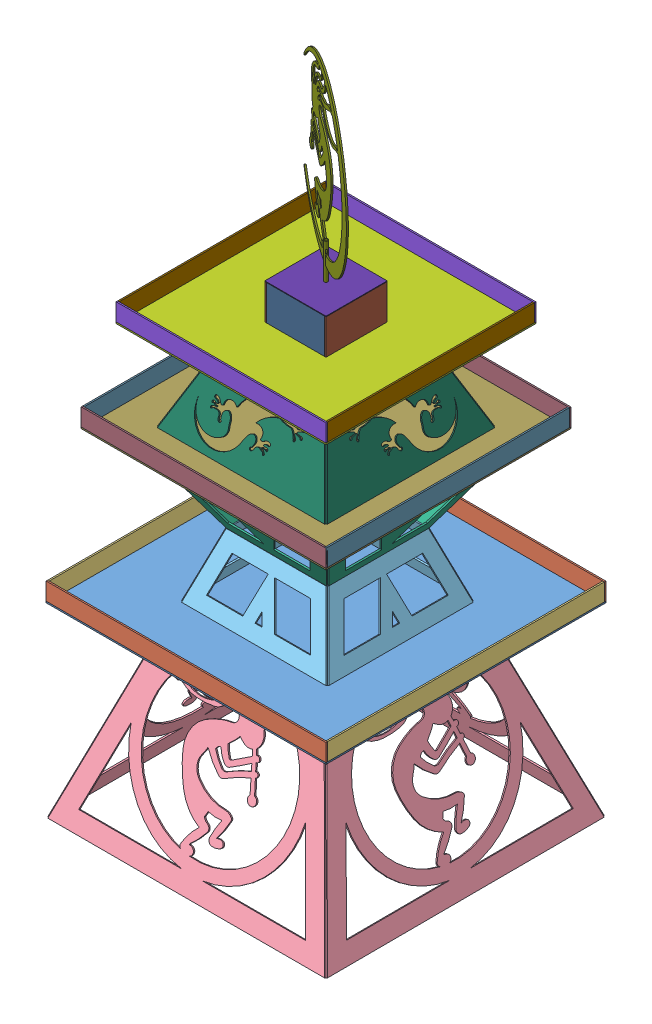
SolidWorks assembly full fountain.SLDASM, configuration Default (file format 8000). Lengths in mm.
Overall size (1229.96 3197.6 1720.92).
51 component instances, 18 part files, 28 mates.
Components (placement in the parent):
- Platform1-1: Platform1.SLDASM [Default] at (456.1958 589.5561 967.1555) size (1219.2 82.55 1219.2)
  - Platform1-1: Platform1.SLDPRT [Default] at (550.3577 745.2678 809.346) size (1219.2 6.35 1219.2)
  - Platform1-inner-shortside-1: Platform1-inner-shortside.SLDPRT [Default] at (550.3577 789.7178 936.346) (suppressed, hidden)
  - Platform1-inner-shortside-2: Platform1-inner-shortside.SLDPRT [Default] at (550.3577 789.7178 675.996) (suppressed, hidden)
  - Platform1-longside-1: Platform1-longside.SLDPRT [Default] at (550.3577 789.7178 1412.596) size (1219.2 76.2 6.35)
  - Platform1-longside-2: Platform1-longside.SLDPRT [Default] at (550.3577 789.7178 199.746) size (1219.2 76.2 6.35)
  - Platform1-outer-shortside-1: Platform1-outer-shortside.SLDPRT [Default] at (683.7077 789.7178 809.346) x (0 0 1) z (-1 0 0) (suppressed, hidden)
  - Platform1-outer-shortside-2: Platform1-outer-shortside.SLDPRT [Default] at (417.0077 789.7178 809.346) x (0 0 -1) z (1 0 0) (suppressed, hidden)
  - Platform1-shortside-1: Platform1-shortside.SLDPRT [Default] at (-52.8923 789.7178 809.346) x (0 0 1) z (-1 0 0) size (1206.5 76.2 6.35)
  - Platform1-shortside-2: Platform1-shortside.SLDPRT [Default] at (1153.6077 789.7178 809.346) x (0 0 -1) z (1 0 0) size (1206.5 76.2 6.35)
- Base1-1: Base1.SLDASM [Default] at (716.703 -86.3541 1585.036) x (1 0 0) z (0 0.326754 0.94511) size (1218.49 1173.84 1415.04)
  - Base1-1: Base1.SLDPRT [Default] at (317.5976 867.0186 935.9413) size (1206.5 868.38 6.35)
  - Base1-2: Base1.SLDPRT [Default] at (-140.6422 992.5277 576.7294) x (0 -0.329847 0.944034) z (-0.944034 0.311387 0.108799) size (1206.5 868.38 6.35)
  - Base1-3: Base1.SLDPRT [Default] at (239.865 1143.6766 144.1352) x (-1 0 0) z (0 0.622773 -0.782402) size (1206.5 868.38 6.35)
  - Base1-4: Base1.SLDPRT [Default] at (698.1048 1018.1676 503.3471) x (0 0.329847 -0.944034) z (0.944034 0.311387 0.108799) size (1206.5 868.38 6.35)
- base2 complete-1: base2 complete.SLDASM [Default] at (1041.5807 844.5542 1343.6375) x (1 0 0) z (0 0.329847 0.944034) size (890.2 1019.95 1086.26)
  - base2-tier1-1: base2-tier1.SLDASM [Default] at (-389.5691 -72.3187 234.6343) size (641.44 472.69 691.8)
    - Base-2-tier-1: Base-2-tier.SLDPRT [Default] at (399.4513 -22.7257 634.9553) size (629.45 295.21 6.35)
    - Base-2-tier-2: Base-2-tier.SLDPRT [Default] at (-58.7885 102.7833 275.7433) x (0 -0.329847 0.944034) z (-0.944034 0.311387 0.108799) size (629.45 295.21 6.35)
    - Base-2-tier-3: Base-2-tier.SLDPRT [Default] at (399.4513 257.8869 -161.8191) x (1 0 0) z (0 -0.622773 0.782402) size (629.45 295.21 6.35)
    - Base-2-tier-4: Base-2-tier.SLDPRT [Default] at (779.9585 128.4232 202.361) x (0 0.329847 -0.944034) z (0.944034 0.311387 0.108799) size (629.45 295.21 6.35)
  - base2-tier2-1: base2-tier2.SLDASM [Default] at (-355.6529 289.7699 -162.2429) x (1 0 0) z (0 0.207011 0.978339) size (890.2 772.31 946.89)
    - Base-2-tier2-2: Base-2-tier2.SLDPRT [Default] at (232.6721 -344.3629 633.1329) x (0 -0.518128 0.855303) z (-0.855303 0.443156 0.268456) size (879.34 429.08 6.35)
    - Base-2-tier2-3: Base-2-tier2.SLDPRT [Default] at (366.0986 -269.6028 516.0722) x (1 0 0) z (0 -0.886313 0.463087) size (879.34 429.08 6.35)
    - Base-2-tier2-4: Base-2-tier2.SLDPRT [Default] at (421.7924 -304.0874 566.648) x (0 0.518128 -0.855303) z (0.855303 0.443156 0.268456) size (879.34 429.08 6.35)
    - Base-2-tier2-5: Base-2-tier2.SLDPRT [Default] at (366.0986 -373.2194 680.7681) size (879.34 429.08 6.35)
- platform2-1: platform2.SLDASM [Default] at (696.2257 1865.4779 1091.7444) size (914.4 158.75 914.4)
  - Platform2-1: Platform2.SLDPRT [Default] at (310.3277 523.2857 684.7571) size (914.4 6.35 914.4)
  - Platform2-longside-1: Platform2-longside.SLDPRT [Default] at (310.3277 567.7357 1135.6071) size (914.4 76.2 6.35)
  - Platform2-shortside-1: Platform2-shortside.SLDPRT [Default] at (767.5277 567.7357 684.7571) x (0 0 1) z (-1 0 0) size (901.7 76.2 6.35)
  - Platform2-shortside-2: Platform2-shortside.SLDPRT [Default] at (-140.5223 567.7357 684.7571) x (0 0 1) z (-1 0 0) size (901.7 76.2 6.35)
  - Platform2-longside-3: Platform2-longside.SLDPRT [Default] at (310.3277 567.7357 227.5571) size (914.4 76.2 6.35)
  - Platform1-inner-shortside-1: Platform1-inner-shortside.SLDPRT [Default] at (310.3277 605.8357 551.4071)
  - Platform1-inner-shortside-3: Platform1-inner-shortside.SLDPRT [Default] at (310.3277 605.8357 811.7571)
  - Platform1-outer-shortside-3: Platform1-outer-shortside.SLDPRT [Default] at (437.3277 605.8357 684.7571) x (0 0 -1) z (1 0 0)
  - Platform1-outer-shortside-4: Platform1-outer-shortside.SLDPRT [Default] at (176.9777 605.8357 684.7571) x (0 0 -1) z (1 0 0)
- platoform3-middle-1: platoform3-middle.SLDASM [Default] at (571.6289 1389.8373 1010.4984) size (1066.8 82.55 1066.8)
  - Platform3-1: Platform3.SLDPRT [Default] at (434.9246 602.3995 766.003) size (1066.8 6.35 1066.8)
  - Platform3-longside-1: Platform3-longside.SLDPRT [Default] at (434.9246 646.8495 1293.053) size (1066.8 76.2 6.35)
  - Platform3-longside-2: Platform3-longside.SLDPRT [Default] at (434.9246 646.8495 232.603) size (1066.8 76.2 6.35)
  - Platform3-shortside-1: Platform3-shortside.SLDPRT [Default] at (968.3246 646.8495 769.178) x (0 0 1) z (-1 0 0) size (1060.45 76.2 6.35)
  - Platform3-shortside-2: Platform3-shortside.SLDPRT [Default] at (-92.1254 646.8495 769.178) x (0 0 1) z (-1 0 0) size (1060.45 76.2 6.35)
- tier3SLDASM-1: tier3SLDASM.SLDASM [Default] at (533.7527 1051.5559 1454.4573) x (1 0 0) z (0 0.408392 0.912807) size (740.82 653.97 829.22)
  - Base-3-tier-1: Base-3-tier.SLDPRT [Default] at (513.7761 -477.851 1015.4516) size (729.23 424.61 6.35)
  - Base-3-tier-2: Base-3-tier.SLDPRT [Default] at (513.7761 178.619 -445.4892) x (1 0 0) z (0 -0.745566 0.666432) size (729.23 424.61 6.35)
  - Base-3-tier-3: Base-3-tier.SLDPRT [Default] at (1278.6348 -165.4887 323.6336) x (0 -0.408392 0.912807) z (-0.912807 -0.372783 -0.166784) size (729.23 424.61 6.35)
  - Base-3-tier-4: Base-3-tier.SLDPRT [Default] at (-323.0188 -167.8559 322.5746) x (0 -0.408392 0.912807) z (-0.912807 0.372783 0.166784) size (729.23 424.61 6.35)
- Topper-1: Topper.SLDPRT [Default] at (918.1666 3074.9856 1721.7747) x (-0.833999 0 -0.551765) z (0.551765 0 -0.833999) size (655.16 785.54 15.88)
- top plate-1: top plate.SLDASM [Default] at (890.1202 2361.7834 1928.4355) x (1 0 0) z (0 1 0) size (266.7 266.7 103.12)
  - Top Plate-1: Top Plate.SLDPRT [Default] at (-16.9168 285.284 185.7302) size (266.7 266.7 2.79)
  - Tube For Top-1: Tube For Top.SLDPRT [Default] at (116.4332 151.934 288.8542) x (1 0 0) z (0 1 0) size (12.7 100.33 12.7)
Mates (geometry in assembly coordinates):
- Coincident1: coincident: plane of Platform1-1/Platform1-1 through (1006.5535 1334.8239 1776.5014) normal (0 -1 0); line of Base1-1/Base1-3 through (1312.252 1334.8239 1451.0755) axis (-1 0 0)
- Coincident2: coincident: line of Base1-1/Base1-1 through (678.6167 1334.8239 2090.7088) axis (1 0 0); plane of Platform1-1/Platform1-1 through (1006.5535 1334.8239 1776.5014) normal (0 -1 0)
- Coincident3: coincident: plane of Platform1-1/Platform1-1 through (1006.5535 1341.1739 1776.5014) normal (0 1 0); line of base2 complete-1/base2-tier1-1/Base-2-tier-1 through (697.8735 1341.1739 2091.2597) axis (1 0 0)
- Coincident4: coincident: plane of Platform1-1/Platform1-1 through (1006.5535 1341.1739 1776.5014) normal (0 1 0); line of base2 complete-1/base2-tier1-1/Base-2-tier-3 through (697.8735 1341.1739 1461.8135) axis (1 0 0)
- Coincident7: coincident aligned: plane of Platform1-1/Platform1-inner-shortside-2 through (1006.5535 1379.2739 1649.5014) normal (0 0 1); plane of platform2-1/Platform1-inner-shortside-1 through (1006.5535 2433.2136 1649.5014) normal (0 0 1)
- Coincident8: coincident aligned: plane of Platform1-1/Platform1-outer-shortside-2 through (879.5535 1379.2739 1776.5014) normal (1 0 0); plane of platform2-1/Platform1-outer-shortside-4 through (879.5535 2433.2136 1776.5014) normal (1 0 0)
- Coincident15: coincident: line of base2 complete-1/base2-tier2-1/Base-2-tier2-2 through (1452.8276 1992.2368 2215.6407) axis (0 0 -1); plane of platoform3-middle-1/Platform3-1 through (1006.5535 1992.2368 1776.5014) normal (0 -1 0)
- Coincident16: coincident: line of base2 complete-1/base2-tier2-1/Base-2-tier2-4 through (573.4926 1992.2368 1336.3056) axis (0 0 1); plane of platoform3-middle-1/Platform3-1 through (1006.5535 1992.2368 1776.5014) normal (0 -1 0)
- Coincident17: coincident: plane of platoform3-middle-1/Platform3-1 through (1006.5535 1998.5868 1776.5014) normal (0 1 0); line of tier3SLDASM-1/Base-3-tier-2 through (644.0498 1998.5868 1413.9774) axis (1 0 0)
- Coincident18: coincident: plane of platoform3-middle-1/Platform3-1 through (1006.5535 1998.5868 1776.5014) normal (0 1 0); line of tier3SLDASM-1/Base-3-tier-1 through (644.0498 1998.5868 2143.203) axis (1 0 0)
- Coincident19: coincident: plane of platform2-1/Platform2-1 through (1006.5535 2388.7636 1776.5014) normal (0 -1 0); line of tier3SLDASM-1/Base-3-tier-2 through (817.4557 2388.7636 1581.587) axis (1 0 0)
- Parallel1: parallel aligned: plane of platform2-1/Platform2-shortside-2 through (549.3535 2433.2136 1776.5014) normal (-1 0 0); plane of platoform3-middle-1/Platform3-shortside-2 through (473.1535 2036.6868 1779.6764) normal (-1 0 0)
- Parallel3: parallel aligned: plane of Platform1-1/Platform1-shortside-1 through (396.9535 1379.2739 1776.5014) normal (-1 0 0); plane of platoform3-middle-1/Platform3-shortside-2 through (473.1535 2036.6868 1779.6764) normal (-1 0 0)
- Parallel4: parallel aligned: plane of platform2-1/Platform2-shortside-2 through (549.3535 2433.2136 1776.5014) normal (-1 0 0); plane of platoform3-middle-1/Platform3-shortside-2 through (473.1535 2036.6868 1779.6764) normal (-1 0 0)
- Coincident24: coincident anti-aligned: plane of platform2-1/Platform1-outer-shortside-3 through (1139.9035 2547.5136 1909.8514) normal (0 1 0); plane of top plate-1/Top Plate-1 through (873.2035 2547.5136 1643.1514) normal (0 -1 0)
- Coincident25: coincident aligned: plane of platform2-1/Platform1-inner-shortside-1 through (1006.5535 2471.3136 1643.1514) normal (0 0 -1); plane of top plate-1/Top Plate-1 through (873.2035 2550.3076 1643.1514) normal (0 0 -1)
- Coincident26: coincident aligned: plane of platform2-1/Platform1-outer-shortside-3 through (1139.9035 2471.3136 1776.5014) normal (1 0 0); plane of top plate-1/Top Plate-1 through (1139.9035 2550.3076 1643.1514) normal (1 0 0)
- Concentric1: concentric anti-aligned: cylinder of Topper-1 through (1006.5535 3335.8442 1776.5014) axis (0 -1 0) radius 6.7143; cylinder of top plate-1/Tube For Top-1 through (1006.5535 2550.3076 1776.5014) axis (0 1 0) radius 6.35
- Coincident27: coincident anti-aligned: circle of Topper-1; plane of top plate-1/Top Plate-1 through (873.2035 2550.3076 1643.1514) normal (0 1 0)
- Coincident28: coincident: plane of platform2-1/Platform2-1 through (1006.5535 2388.7636 1776.5014) normal (0 -1 0); line of tier3SLDASM-1/Base-3-tier-2 through (817.4557 2388.7636 1581.587) axis (1 0 0)
- Coincident29: coincident: plane of platform2-1/Platform2-1 through (1006.5535 2388.7636 1776.5014) normal (0 -1 0); line of tier3SLDASM-1/Base-3-tier-1 through (817.4557 2388.7636 1975.5934) axis (1 0 0)
- Distance1: distance = 76.2 mm aligned: plane of platoform3-middle-1/Platform3-longside-2 through (1006.5535 2036.6868 1243.1014) normal (0 0 -1); plane of Platform1-1/Platform1-longside-2 through (1006.5535 1379.2739 1166.9014) normal (0 0 -1)
- Distance2: distance = 76.2 mm aligned: plane of platoform3-middle-1/Platform3-shortside-1 through (1539.9535 2036.6868 1779.6764) normal (1 0 0); plane of Platform1-1/Platform1-shortside-2 through (1616.1535 1379.2739 1776.5014) normal (1 0 0)
- Distance3: distance = 76.2 mm aligned: plane of platform2-1/Platform2-shortside-1 through (1463.7535 2433.2136 1776.5014) normal (1 0 0); plane of platoform3-middle-1/Platform3-shortside-1 through (1539.9535 2036.6868 1779.6764) normal (1 0 0)
- Distance4: distance = 76.2 mm aligned: plane of platform2-1/Platform2-longside-3 through (1006.5535 2433.2136 1319.3014) normal (0 0 -1); plane of platoform3-middle-1/Platform3-longside-2 through (1006.5535 2036.6868 1243.1014) normal (0 0 -1)
- Distance5: distance = 165.1 mm: line of tier3SLDASM-1/Base-3-tier-4 through (638.2535 2001.1801 1413.9774) axis (0 0 1); plane of platoform3-middle-1/Platform3-shortside-2 through (473.1535 2036.6868 1779.6764) normal (-1 0 0)
- Distance6: distance = 165.1 mm: line of tier3SLDASM-1/Base-3-tier-2 through (644.0498 2001.1801 1408.1811) axis (1 0 0); line of platoform3-middle-1/Platform3-longside-2 through (473.1535 1998.5868 1243.1014) axis (1 0 0)
- Distance8: distance = 288.925 mm: line of base2 complete-1/base2-tier1-1/Base-2-tier-3 through (697.8735 1343.2684 1455.8189) axis (1 0 0); line of Platform1-1/Platform1-longside-2 through (396.9535 1341.1739 1166.9014) axis (1 0 0)
